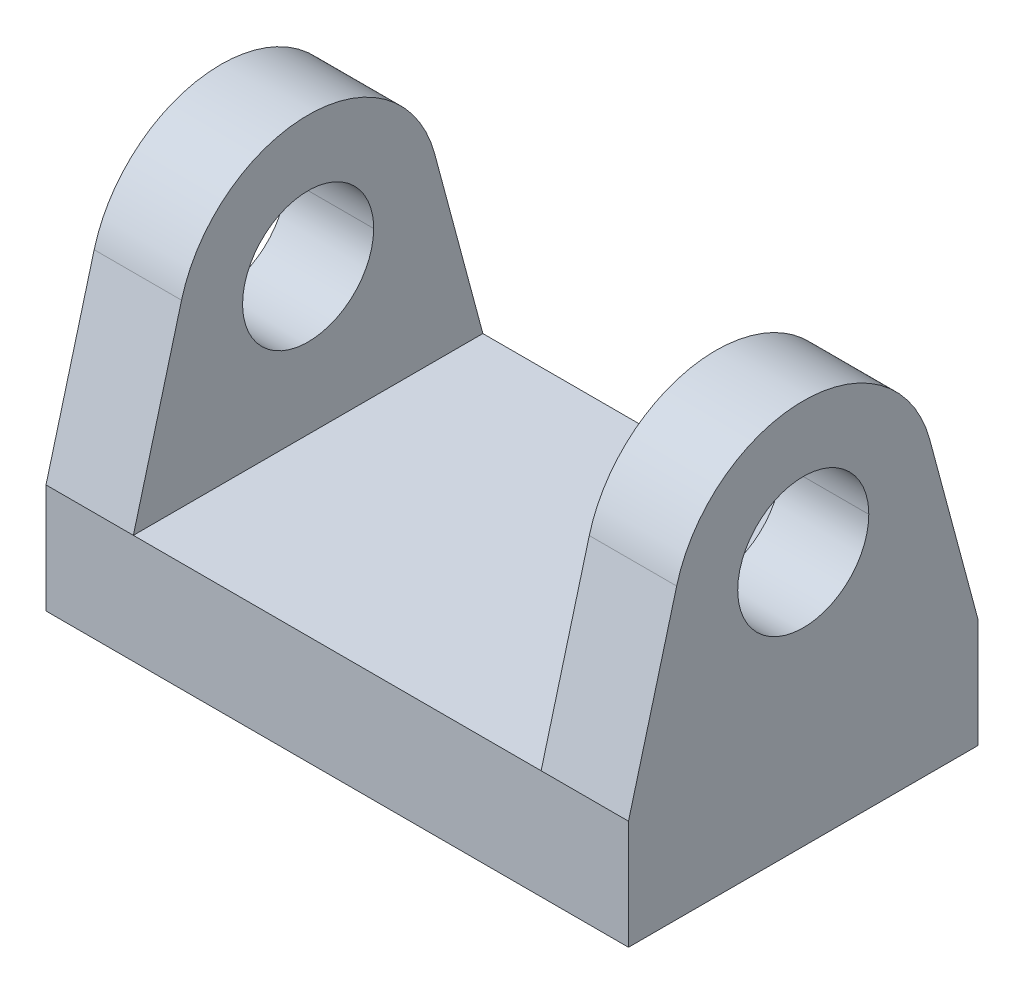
ISO-10303-21;
HEADER;
FILE_DESCRIPTION(('STEP AP214'),'2;1');
FILE_NAME('part.step','',(''),(''),'','','');
FILE_SCHEMA(('AUTOMOTIVE_DESIGN { 1 0 10303 214 1 1 1 1 }'));
ENDSEC;
DATA;
#1=APPLICATION_CONTEXT('core data for automotive mechanical design processes');
#2=APPLICATION_PROTOCOL_DEFINITION('international standard','automotive_design',2000,#1);
#3=PRODUCT_CONTEXT('',#1,'mechanical');
#4=PRODUCT('Part','Part','',(#3));
#5=PRODUCT_RELATED_PRODUCT_CATEGORY('part','',(#4));
#6=PRODUCT_DEFINITION_FORMATION('','',#4);
#7=PRODUCT_DEFINITION_CONTEXT('part definition',#1,'design');
#8=PRODUCT_DEFINITION('design','',#6,#7);
#9=PRODUCT_DEFINITION_SHAPE('','',#8);
#10=(LENGTH_UNIT() NAMED_UNIT(*) SI_UNIT(.MILLI.,.METRE.));
#11=(NAMED_UNIT(*) PLANE_ANGLE_UNIT() SI_UNIT($,.RADIAN.));
#12=(NAMED_UNIT(*) SI_UNIT($,.STERADIAN.) SOLID_ANGLE_UNIT());
#13=UNCERTAINTY_MEASURE_WITH_UNIT(LENGTH_MEASURE(1.E-05),#10,'distance_accuracy_value','');
#14=(GEOMETRIC_REPRESENTATION_CONTEXT(3) GLOBAL_UNCERTAINTY_ASSIGNED_CONTEXT((#13)) GLOBAL_UNIT_ASSIGNED_CONTEXT((#10,
#11,#12)) REPRESENTATION_CONTEXT('',''));
#15=CARTESIAN_POINT('',(0.,0.,0.));
#16=DIRECTION('',(0.,0.,1.));
#17=DIRECTION('',(1.,0.,0.));
#18=AXIS2_PLACEMENT_3D('',#15,#16,#17);
#19=CARTESIAN_POINT('',(-14.,7.5,-12.));
#20=DIRECTION('',(0.,1.,0.));
#21=DIRECTION('',(0.,0.,1.));
#22=AXIS2_PLACEMENT_3D('',#19,#20,#21);
#23=PLANE('',#22);
#24=CARTESIAN_POINT('',(-14.,7.5,12.));
#25=DIRECTION('',(1.,0.,0.));
#26=VECTOR('',#25,1.);
#27=LINE('',#24,#26);
#28=CARTESIAN_POINT('',(-14.,7.5,12.));
#29=VERTEX_POINT('',#28);
#30=CARTESIAN_POINT('',(14.,7.5,12.));
#31=VERTEX_POINT('',#30);
#32=EDGE_CURVE('E11',#29,#31,#27,.T.);
#33=ORIENTED_EDGE('',*,*,#32,.T.);
#34=CARTESIAN_POINT('',(14.,7.5,-12.));
#35=DIRECTION('',(0.,0.,1.));
#36=VECTOR('',#35,1.);
#37=LINE('',#34,#36);
#38=CARTESIAN_POINT('',(14.,7.5,-12.));
#39=VERTEX_POINT('',#38);
#40=EDGE_CURVE('E25',#39,#31,#37,.T.);
#41=ORIENTED_EDGE('',*,*,#40,.F.);
#42=CARTESIAN_POINT('',(14.,7.5,-12.));
#43=DIRECTION('',(-1.,0.,0.));
#44=VECTOR('',#43,1.);
#45=LINE('',#42,#44);
#46=CARTESIAN_POINT('',(-14.,7.5,-12.));
#47=VERTEX_POINT('',#46);
#48=EDGE_CURVE('E520',#39,#47,#45,.T.);
#49=ORIENTED_EDGE('',*,*,#48,.T.);
#50=CARTESIAN_POINT('',(-14.,7.5,-12.));
#51=DIRECTION('',(0.,0.,1.));
#52=VECTOR('',#51,1.);
#53=LINE('',#50,#52);
#54=EDGE_CURVE('E519',#47,#29,#53,.T.);
#55=ORIENTED_EDGE('',*,*,#54,.T.);
#56=EDGE_LOOP('',(#33,#41,#49,#55));
#57=FACE_BOUND('',#56,.T.);
#58=ADVANCED_FACE('F17',(#57),#23,.T.);
#59=CARTESIAN_POINT('',(-14.,7.5,-12.));
#60=DIRECTION('',(1.,0.,0.));
#61=DIRECTION('',(0.,1.,0.));
#62=AXIS2_PLACEMENT_3D('',#59,#60,#61);
#63=PLANE('',#62);
#64=CARTESIAN_POINT('',(-14.,19.8313594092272,-8.69279950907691));
#65=DIRECTION('',(0.,-0.965866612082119,-0.259039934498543));
#66=VECTOR('',#65,1.);
#67=LINE('',#64,#66);
#68=CARTESIAN_POINT('',(-14.,19.8313476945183,-8.69275582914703));
#69=VERTEX_POINT('',#68);
#70=EDGE_CURVE('E508',#69,#47,#67,.T.);
#71=ORIENTED_EDGE('',*,*,#70,.F.);
#72=CARTESIAN_POINT('',(-14.,17.5,0.));
#73=DIRECTION('',(-1.,0.,0.));
#74=DIRECTION('',(0.,0.259039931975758,0.965866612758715));
#75=AXIS2_PLACEMENT_3D('',#72,#73,#74);
#76=CIRCLE('',#75,9.);
#77=CARTESIAN_POINT('',(-14.,19.8313560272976,8.69278698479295));
#78=VERTEX_POINT('',#77);
#79=EDGE_CURVE('E312',#78,#69,#76,.T.);
#80=ORIENTED_EDGE('',*,*,#79,.F.);
#81=CARTESIAN_POINT('',(-14.,7.50000000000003,12.));
#82=DIRECTION('',(0.,0.965866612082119,-0.259039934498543));
#83=VECTOR('',#82,1.);
#84=LINE('',#81,#83);
#85=EDGE_CURVE('E391',#29,#78,#84,.T.);
#86=ORIENTED_EDGE('',*,*,#85,.F.);
#87=ORIENTED_EDGE('',*,*,#54,.F.);
#88=EDGE_LOOP('',(#71,#80,#86,#87));
#89=FACE_BOUND('',#88,.T.);
#90=CARTESIAN_POINT('',(-14.,17.5,-4.5));
#91=CARTESIAN_POINT('',(-14.,17.4997647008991,-4.5));
#92=CARTESIAN_POINT('',(-14.,17.4995294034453,-4.49999998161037));
#93=CARTESIAN_POINT('',(-14.,16.5289747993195,-4.49984827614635));
#94=CARTESIAN_POINT('',(-14.,15.5866983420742,-4.18697437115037));
#95=CARTESIAN_POINT('',(-14.,14.1734421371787,-3.13224492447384));
#96=CARTESIAN_POINT('',(-14.,13.6737251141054,-2.49778943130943));
#97=CARTESIAN_POINT('',(-14.,13.122840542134,-1.2092501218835));
#98=CARTESIAN_POINT('',(-14.,12.9999726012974,-0.6081804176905));
#99=CARTESIAN_POINT('',(-14.,13.0000396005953,0.8790309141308));
#100=CARTESIAN_POINT('',(-14.,13.2568283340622,1.7373965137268));
#101=CARTESIAN_POINT('',(-14.,14.2145541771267,3.1939900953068));
#102=CARTESIAN_POINT('',(-14.,14.8877094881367,3.7647691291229));
#103=CARTESIAN_POINT('',(-14.,16.2522533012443,4.3689504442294));
#104=CARTESIAN_POINT('',(-14.,16.8723513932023,4.4997411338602));
#105=CARTESIAN_POINT('',(-14.,17.5,4.5));
#106=B_SPLINE_CURVE_WITH_KNOTS('',3,(#90,#91,#92,#93,#94,#95,#96,#97,#98,#99,#100,#101,#102,
#103,#104,#105),.UNSPECIFIED.,.F.,.F.,(4,2,2,2,2,2,2,4),(0.,4.95943433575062E-05,
0.204568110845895,0.371873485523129,0.500067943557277,0.685353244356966,0.867637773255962,1.),.UNSPECIFIED.);
#107=CARTESIAN_POINT('',(-14.,17.5,-4.5));
#108=VERTEX_POINT('',#107);
#109=CARTESIAN_POINT('',(-14.,17.5,4.5));
#110=VERTEX_POINT('',#109);
#111=EDGE_CURVE('E521',#108,#110,#106,.T.);
#112=ORIENTED_EDGE('',*,*,#111,.T.);
#113=CARTESIAN_POINT('',(-14.,17.5,4.5));
#114=CARTESIAN_POINT('',(-14.,18.4508974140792,4.4996078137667));
#115=CARTESIAN_POINT('',(-14.,19.3756842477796,4.1996162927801));
#116=CARTESIAN_POINT('',(-14.,20.7869061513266,3.17402896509));
#117=CARTESIAN_POINT('',(-14.,21.2944527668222,2.5458609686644));
#118=CARTESIAN_POINT('',(-14.,21.8692068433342,1.2468617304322));
#119=CARTESIAN_POINT('',(-14.,21.9999717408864,0.627279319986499));
#120=CARTESIAN_POINT('',(-14.,22.0000408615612,-0.907021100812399));
#121=CARTESIAN_POINT('',(-14.,21.7267205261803,-1.7911249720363));
#122=CARTESIAN_POINT('',(-14.,20.7668964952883,-3.19443306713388));
#123=CARTESIAN_POINT('',(-14.,20.1535211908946,-3.71987599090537));
#124=CARTESIAN_POINT('',(-14.,18.8323061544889,-4.35049837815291));
#125=CARTESIAN_POINT('',(-14.,18.1709183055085,-4.5));
#126=CARTESIAN_POINT('',(-14.,17.5,-4.5));
#127=B_SPLINE_CURVE_WITH_KNOTS('',3,(#113,#114,#115,#116,#117,#118,#119,#120,#121,#122,#123,
#124,#125,#126),.UNSPECIFIED.,.F.,.F.,(4,2,2,2,2,2,4),(0.,0.200521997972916,0.367836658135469,
0.50006402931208,0.691259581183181,0.858575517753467,1.),.UNSPECIFIED.);
#128=EDGE_CURVE('E522',#110,#108,#127,.T.);
#129=ORIENTED_EDGE('',*,*,#128,.T.);
#130=EDGE_LOOP('',(#112,#129));
#131=FACE_BOUND('',#130,.T.);
#132=ADVANCED_FACE('F560',(#89,#131),#63,.T.);
#133=CARTESIAN_POINT('',(-14.,17.5,0.));
#134=DIRECTION('',(-1.,0.,0.));
#135=DIRECTION('',(0.,-1.,0.));
#136=AXIS2_PLACEMENT_3D('',#133,#134,#135);
#137=CYLINDRICAL_SURFACE('',#136,4.5);
#138=ORIENTED_EDGE('',*,*,#128,.F.);
#139=CARTESIAN_POINT('',(-14.,17.5,4.5));
#140=DIRECTION('',(-1.,0.,0.));
#141=VECTOR('',#140,1.);
#142=LINE('',#139,#141);
#143=CARTESIAN_POINT('',(-20.,17.5,4.5));
#144=VERTEX_POINT('',#143);
#145=EDGE_CURVE('E527',#110,#144,#142,.T.);
#146=ORIENTED_EDGE('',*,*,#145,.T.);
#147=CARTESIAN_POINT('',(-20.,17.5,0.));
#148=DIRECTION('',(-1.,0.,0.));
#149=DIRECTION('',(0.,0.,1.));
#150=AXIS2_PLACEMENT_3D('',#147,#148,#149);
#151=CIRCLE('',#150,4.5);
#152=CARTESIAN_POINT('',(-20.,17.5,-4.5));
#153=VERTEX_POINT('',#152);
#154=EDGE_CURVE('E530',#144,#153,#151,.T.);
#155=ORIENTED_EDGE('',*,*,#154,.T.);
#156=CARTESIAN_POINT('',(-20.,17.5,-4.5));
#157=DIRECTION('',(1.,0.,0.));
#158=VECTOR('',#157,1.);
#159=LINE('',#156,#158);
#160=EDGE_CURVE('E535',#153,#108,#159,.T.);
#161=ORIENTED_EDGE('',*,*,#160,.T.);
#162=EDGE_LOOP('',(#138,#146,#155,#161));
#163=FACE_BOUND('',#162,.T.);
#164=ADVANCED_FACE('F552',(#163),#137,.F.);
#165=CARTESIAN_POINT('',(-14.,17.5,0.));
#166=DIRECTION('',(-1.,0.,0.));
#167=DIRECTION('',(0.,1.,0.));
#168=AXIS2_PLACEMENT_3D('',#165,#166,#167);
#169=CYLINDRICAL_SURFACE('',#168,4.5);
#170=CARTESIAN_POINT('',(-20.,17.5,0.));
#171=DIRECTION('',(-1.,0.,0.));
#172=DIRECTION('',(0.,0.,-1.));
#173=AXIS2_PLACEMENT_3D('',#170,#171,#172);
#174=CIRCLE('',#173,4.5);
#175=EDGE_CURVE('E486',#153,#144,#174,.T.);
#176=ORIENTED_EDGE('',*,*,#175,.T.);
#177=ORIENTED_EDGE('',*,*,#145,.F.);
#178=ORIENTED_EDGE('',*,*,#111,.F.);
#179=ORIENTED_EDGE('',*,*,#160,.F.);
#180=EDGE_LOOP('',(#176,#177,#178,#179));
#181=FACE_BOUND('',#180,.T.);
#182=ADVANCED_FACE('F432',(#181),#169,.F.);
#183=CARTESIAN_POINT('',(-20.,0.,12.));
#184=DIRECTION('',(-1.,0.,0.));
#185=DIRECTION('',(0.,1.,0.));
#186=AXIS2_PLACEMENT_3D('',#183,#184,#185);
#187=PLANE('',#186);
#188=CARTESIAN_POINT('',(-20.,0.,-12.));
#189=DIRECTION('',(0.,0.,1.));
#190=VECTOR('',#189,1.);
#191=LINE('',#188,#190);
#192=CARTESIAN_POINT('',(-20.,0.,-12.));
#193=VERTEX_POINT('',#192);
#194=CARTESIAN_POINT('',(-20.,0.,12.));
#195=VERTEX_POINT('',#194);
#196=EDGE_CURVE('E410',#193,#195,#191,.T.);
#197=ORIENTED_EDGE('',*,*,#196,.T.);
#198=CARTESIAN_POINT('',(-20.,7.5,12.));
#199=DIRECTION('',(0.,-1.,0.));
#200=VECTOR('',#199,1.);
#201=LINE('',#198,#200);
#202=CARTESIAN_POINT('',(-20.,7.5,12.));
#203=VERTEX_POINT('',#202);
#204=EDGE_CURVE('E409',#203,#195,#201,.T.);
#205=ORIENTED_EDGE('',*,*,#204,.F.);
#206=CARTESIAN_POINT('',(-20.,7.5,12.));
#207=CARTESIAN_POINT('',(-20.,11.610472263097,10.8976571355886));
#208=CARTESIAN_POINT('',(-20.,15.7209445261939,9.79531427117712));
#209=CARTESIAN_POINT('',(-20.,19.8313593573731,8.69279952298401));
#210=CARTESIAN_POINT('',(-20.,19.8313593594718,8.69279952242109));
#211=CARTESIAN_POINT('',(-20.,19.8313593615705,8.69279952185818));
#212=B_SPLINE_CURVE_WITH_KNOTS('',3,(#206,#207,#208,#209,#210,#211),.UNSPECIFIED.,.F.,.F.,(4,2,
4),(0.,39.1716991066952,39.1716991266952),.UNSPECIFIED.);
#213=CARTESIAN_POINT('',(-20.,19.8313593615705,8.69279952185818));
#214=VERTEX_POINT('',#213);
#215=EDGE_CURVE('E407',#203,#214,#212,.T.);
#216=ORIENTED_EDGE('',*,*,#215,.T.);
#217=CARTESIAN_POINT('',(-20.,19.8313593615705,8.69279952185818));
#218=CARTESIAN_POINT('',(-20.,21.1479484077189,8.3396205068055));
#219=CARTESIAN_POINT('',(-20.,22.3662187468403,7.6929787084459));
#220=CARTESIAN_POINT('',(-20.,24.3934035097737,5.93499844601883));
#221=CARTESIAN_POINT('',(-20.,25.1884912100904,4.86104213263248));
#222=CARTESIAN_POINT('',(-20.,26.7842153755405,1.2706132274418));
#223=CARTESIAN_POINT('',(-20.,26.7567034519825,-1.45737566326));
#224=CARTESIAN_POINT('',(-20.,25.0044916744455,-5.1951072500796));
#225=CARTESIAN_POINT('',(-20.,24.0218412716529,-6.3854683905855));
#226=CARTESIAN_POINT('',(-20.,21.900771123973,-7.9280197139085));
#227=CARTESIAN_POINT('',(-20.,20.8971638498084,-8.4068624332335));
#228=CARTESIAN_POINT('',(-20.,19.8313494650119,-8.6927624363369));
#229=B_SPLINE_CURVE_WITH_KNOTS('',3,(#217,#218,#219,#220,#221,#222,#223,#224,#225,#226,#227,
#228),.UNSPECIFIED.,.F.,.F.,(4,2,2,2,2,4),(0.,0.172228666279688,0.339009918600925,
0.668642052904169,0.860572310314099,1.),.UNSPECIFIED.);
#230=CARTESIAN_POINT('',(-20.,19.8313494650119,-8.69276243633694));
#231=VERTEX_POINT('',#230);
#232=EDGE_CURVE('E310',#214,#231,#229,.T.);
#233=ORIENTED_EDGE('',*,*,#232,.T.);
#234=CARTESIAN_POINT('',(-20.,19.8313494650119,-8.6927624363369));
#235=CARTESIAN_POINT('',(-20.,19.8313487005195,-8.6927626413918));
#236=CARTESIAN_POINT('',(-20.,19.8313479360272,-8.6927628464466));
#237=CARTESIAN_POINT('',(-20.,15.7209306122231,-9.7952726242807));
#238=CARTESIAN_POINT('',(-20.,11.6104653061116,-10.8976363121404));
#239=CARTESIAN_POINT('',(-20.,7.5,-12.));
#240=B_SPLINE_CURVE_WITH_KNOTS('',3,(#234,#235,#236,#237,#238,#239),.UNSPECIFIED.,.F.,.F.,(4,2,
4),(0.,1.85989000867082E-07,1.),.UNSPECIFIED.);
#241=CARTESIAN_POINT('',(-20.,7.5,-12.));
#242=VERTEX_POINT('',#241);
#243=EDGE_CURVE('E320',#231,#242,#240,.T.);
#244=ORIENTED_EDGE('',*,*,#243,.T.);
#245=CARTESIAN_POINT('',(-20.,7.5,-12.));
#246=DIRECTION('',(0.,-1.,0.));
#247=VECTOR('',#246,1.);
#248=LINE('',#245,#247);
#249=EDGE_CURVE('E329',#242,#193,#248,.T.);
#250=ORIENTED_EDGE('',*,*,#249,.T.);
#251=EDGE_LOOP('',(#197,#205,#216,#233,#244,#250));
#252=FACE_BOUND('',#251,.T.);
#253=ORIENTED_EDGE('',*,*,#154,.F.);
#254=ORIENTED_EDGE('',*,*,#175,.F.);
#255=EDGE_LOOP('',(#253,#254));
#256=FACE_BOUND('',#255,.T.);
#257=ADVANCED_FACE('F412',(#252,#256),#187,.T.);
#258=CARTESIAN_POINT('',(-20.,0.,-12.));
#259=DIRECTION('',(0.,0.,-1.));
#260=DIRECTION('',(0.,1.,0.));
#261=AXIS2_PLACEMENT_3D('',#258,#259,#260);
#262=PLANE('',#261);
#263=CARTESIAN_POINT('',(20.,0.,-12.));
#264=DIRECTION('',(-1.,0.,0.));
#265=VECTOR('',#264,1.);
#266=LINE('',#263,#265);
#267=CARTESIAN_POINT('',(20.,0.,-12.));
#268=VERTEX_POINT('',#267);
#269=EDGE_CURVE('E474',#268,#193,#266,.T.);
#270=ORIENTED_EDGE('',*,*,#269,.T.);
#271=ORIENTED_EDGE('',*,*,#249,.F.);
#272=CARTESIAN_POINT('',(-14.,7.5,-12.));
#273=DIRECTION('',(-1.,0.,0.));
#274=VECTOR('',#273,1.);
#275=LINE('',#272,#274);
#276=EDGE_CURVE('E324',#47,#242,#275,.T.);
#277=ORIENTED_EDGE('',*,*,#276,.F.);
#278=ORIENTED_EDGE('',*,*,#48,.F.);
#279=CARTESIAN_POINT('',(20.,7.50000000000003,-12.));
#280=DIRECTION('',(-1.,0.,0.));
#281=VECTOR('',#280,1.);
#282=LINE('',#279,#281);
#283=CARTESIAN_POINT('',(20.,7.5,-12.));
#284=VERTEX_POINT('',#283);
#285=EDGE_CURVE('E140',#284,#39,#282,.T.);
#286=ORIENTED_EDGE('',*,*,#285,.F.);
#287=CARTESIAN_POINT('',(20.,7.5,-12.));
#288=DIRECTION('',(0.,-1.,0.));
#289=VECTOR('',#288,1.);
#290=LINE('',#287,#289);
#291=EDGE_CURVE('E477',#284,#268,#290,.T.);
#292=ORIENTED_EDGE('',*,*,#291,.T.);
#293=EDGE_LOOP('',(#270,#271,#277,#278,#286,#292));
#294=FACE_BOUND('',#293,.T.);
#295=ADVANCED_FACE('F431',(#294),#262,.T.);
#296=CARTESIAN_POINT('',(20.,0.,-12.));
#297=DIRECTION('',(1.,0.,0.));
#298=DIRECTION('',(0.,1.,0.));
#299=AXIS2_PLACEMENT_3D('',#296,#297,#298);
#300=PLANE('',#299);
#301=CARTESIAN_POINT('',(20.,0.,12.));
#302=DIRECTION('',(0.,0.,-1.));
#303=VECTOR('',#302,1.);
#304=LINE('',#301,#303);
#305=CARTESIAN_POINT('',(20.,0.,12.));
#306=VERTEX_POINT('',#305);
#307=EDGE_CURVE('E848',#306,#268,#304,.T.);
#308=ORIENTED_EDGE('',*,*,#307,.T.);
#309=ORIENTED_EDGE('',*,*,#291,.F.);
#310=CARTESIAN_POINT('',(20.,19.8313593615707,-8.69279952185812));
#311=DIRECTION('',(0.,-0.965866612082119,-0.259039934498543));
#312=VECTOR('',#311,1.);
#313=LINE('',#310,#312);
#314=CARTESIAN_POINT('',(20.,19.8313476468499,-8.69275584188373));
#315=VERTEX_POINT('',#314);
#316=EDGE_CURVE('E829',#315,#284,#313,.T.);
#317=ORIENTED_EDGE('',*,*,#316,.F.);
#318=CARTESIAN_POINT('',(20.,17.5,0.));
#319=DIRECTION('',(-1.,0.,0.));
#320=DIRECTION('',(0.,0.259039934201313,0.965866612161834));
#321=AXIS2_PLACEMENT_3D('',#318,#319,#320);
#322=CIRCLE('',#321,9.);
#323=CARTESIAN_POINT('',(20.,19.8313494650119,8.69276243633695));
#324=VERTEX_POINT('',#323);
#325=EDGE_CURVE('E146',#324,#315,#322,.T.);
#326=ORIENTED_EDGE('',*,*,#325,.F.);
#327=CARTESIAN_POINT('',(20.,7.5,12.));
#328=DIRECTION('',(0.,0.965866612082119,-0.259039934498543));
#329=VECTOR('',#328,1.);
#330=LINE('',#327,#329);
#331=CARTESIAN_POINT('',(20.,7.5,12.));
#332=VERTEX_POINT('',#331);
#333=EDGE_CURVE('E192',#332,#324,#330,.T.);
#334=ORIENTED_EDGE('',*,*,#333,.F.);
#335=CARTESIAN_POINT('',(20.,7.5,12.));
#336=DIRECTION('',(0.,-1.,0.));
#337=VECTOR('',#336,1.);
#338=LINE('',#335,#337);
#339=EDGE_CURVE('E198',#332,#306,#338,.T.);
#340=ORIENTED_EDGE('',*,*,#339,.T.);
#341=EDGE_LOOP('',(#308,#309,#317,#326,#334,#340));
#342=FACE_BOUND('',#341,.T.);
#343=CARTESIAN_POINT('',(20.,17.5,4.5));
#344=CARTESIAN_POINT('',(20.,18.3197492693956,4.4996669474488));
#345=CARTESIAN_POINT('',(20.,19.1227268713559,4.2766512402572));
#346=CARTESIAN_POINT('',(20.,20.5040291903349,3.443031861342));
#347=CARTESIAN_POINT('',(20.,21.0632568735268,2.8603577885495));
#348=CARTESIAN_POINT('',(20.,21.8777639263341,1.3766605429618));
#349=CARTESIAN_POINT('',(20.,22.0639950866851,0.4776272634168));
#350=CARTESIAN_POINT('',(20.,21.8802043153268,-1.4958009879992));
#351=CARTESIAN_POINT('',(20.,21.3945324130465,-2.50054768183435));
#352=CARTESIAN_POINT('',(20.,19.9173051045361,-3.91588155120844));
#353=CARTESIAN_POINT('',(20.,19.0271154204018,-4.34122325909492));
#354=CARTESIAN_POINT('',(20.,17.8818397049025,-4.48775452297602));
#355=CARTESIAN_POINT('',(20.,17.6910108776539,-4.49992239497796));
#356=CARTESIAN_POINT('',(20.,17.5,-4.5));
#357=B_SPLINE_CURVE_WITH_KNOTS('',3,(#343,#344,#345,#346,#347,#348,#349,#350,#351,#352,#353,
#354,#355,#356),.UNSPECIFIED.,.F.,.F.,(4,2,2,2,2,2,4),(0.,0.172639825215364,0.33972901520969,
0.529069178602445,0.756944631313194,0.959776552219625,1.),.UNSPECIFIED.);
#358=CARTESIAN_POINT('',(20.,17.5,4.5));
#359=VERTEX_POINT('',#358);
#360=CARTESIAN_POINT('',(20.,17.5,-4.5));
#361=VERTEX_POINT('',#360);
#362=EDGE_CURVE('E775',#359,#361,#357,.T.);
#363=ORIENTED_EDGE('',*,*,#362,.T.);
#364=CARTESIAN_POINT('',(20.,17.5,-4.5));
#365=CARTESIAN_POINT('',(20.,16.6802507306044,-4.49966694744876));
#366=CARTESIAN_POINT('',(20.,15.8772731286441,-4.27665124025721));
#367=CARTESIAN_POINT('',(20.,14.4959708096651,-3.443031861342));
#368=CARTESIAN_POINT('',(20.,13.9367431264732,-2.86035778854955));
#369=CARTESIAN_POINT('',(20.,13.1222360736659,-1.3766605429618));
#370=CARTESIAN_POINT('',(20.,12.9360049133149,-0.477627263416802));
#371=CARTESIAN_POINT('',(20.,13.1197956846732,1.4958009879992));
#372=CARTESIAN_POINT('',(20.,13.6054675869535,2.5005476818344));
#373=CARTESIAN_POINT('',(20.,15.0826948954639,3.9158815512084));
#374=CARTESIAN_POINT('',(20.,15.9728845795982,4.3412232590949));
#375=CARTESIAN_POINT('',(20.,17.1181602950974,4.487754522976));
#376=CARTESIAN_POINT('',(20.,17.3089891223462,4.499922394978));
#377=CARTESIAN_POINT('',(20.,17.5,4.5));
#378=B_SPLINE_CURVE_WITH_KNOTS('',3,(#364,#365,#366,#367,#368,#369,#370,#371,#372,#373,#374,
#375,#376,#377),.UNSPECIFIED.,.F.,.F.,(4,2,2,2,2,2,4),(0.,0.172639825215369,0.339729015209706,
0.529069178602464,0.75694463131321,0.959776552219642,1.),.UNSPECIFIED.);
#379=EDGE_CURVE('E725',#361,#359,#378,.T.);
#380=ORIENTED_EDGE('',*,*,#379,.T.);
#381=EDGE_LOOP('',(#363,#380));
#382=FACE_BOUND('',#381,.T.);
#383=ADVANCED_FACE('F747',(#342,#382),#300,.T.);
#384=CARTESIAN_POINT('',(14.,17.5,0.));
#385=DIRECTION('',(1.,0.,0.));
#386=DIRECTION('',(0.,1.,0.));
#387=AXIS2_PLACEMENT_3D('',#384,#385,#386);
#388=CYLINDRICAL_SURFACE('',#387,4.5);
#389=ORIENTED_EDGE('',*,*,#379,.F.);
#390=CARTESIAN_POINT('',(14.,17.5,-4.5));
#391=DIRECTION('',(1.,0.,0.));
#392=VECTOR('',#391,1.);
#393=LINE('',#390,#392);
#394=CARTESIAN_POINT('',(14.,17.5,-4.5));
#395=VERTEX_POINT('',#394);
#396=EDGE_CURVE('E722',#395,#361,#393,.T.);
#397=ORIENTED_EDGE('',*,*,#396,.F.);
#398=CARTESIAN_POINT('',(14.,17.5,0.));
#399=DIRECTION('',(-1.,0.,0.));
#400=DIRECTION('',(0.,0.,-1.));
#401=AXIS2_PLACEMENT_3D('',#398,#399,#400);
#402=CIRCLE('',#401,4.5);
#403=CARTESIAN_POINT('',(14.,17.5,4.5));
#404=VERTEX_POINT('',#403);
#405=EDGE_CURVE('E715',#395,#404,#402,.T.);
#406=ORIENTED_EDGE('',*,*,#405,.T.);
#407=CARTESIAN_POINT('',(20.,17.5,4.5));
#408=DIRECTION('',(-1.,0.,0.));
#409=VECTOR('',#408,1.);
#410=LINE('',#407,#409);
#411=EDGE_CURVE('E723',#359,#404,#410,.T.);
#412=ORIENTED_EDGE('',*,*,#411,.F.);
#413=EDGE_LOOP('',(#389,#397,#406,#412));
#414=FACE_BOUND('',#413,.T.);
#415=ADVANCED_FACE('F739',(#414),#388,.F.);
#416=CARTESIAN_POINT('',(14.,17.5,0.));
#417=DIRECTION('',(1.,0.,0.));
#418=DIRECTION('',(0.,-1.,0.));
#419=AXIS2_PLACEMENT_3D('',#416,#417,#418);
#420=CYLINDRICAL_SURFACE('',#419,4.5);
#421=CARTESIAN_POINT('',(14.,17.5,0.));
#422=DIRECTION('',(-1.,0.,0.));
#423=DIRECTION('',(0.,0.,1.));
#424=AXIS2_PLACEMENT_3D('',#421,#422,#423);
#425=CIRCLE('',#424,4.5);
#426=EDGE_CURVE('E717',#404,#395,#425,.T.);
#427=ORIENTED_EDGE('',*,*,#426,.T.);
#428=ORIENTED_EDGE('',*,*,#396,.T.);
#429=ORIENTED_EDGE('',*,*,#362,.F.);
#430=ORIENTED_EDGE('',*,*,#411,.T.);
#431=EDGE_LOOP('',(#427,#428,#429,#430));
#432=FACE_BOUND('',#431,.T.);
#433=ADVANCED_FACE('F690',(#432),#420,.F.);
#434=CARTESIAN_POINT('',(14.,26.5886691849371,-12.));
#435=DIRECTION('',(-1.,0.,0.));
#436=DIRECTION('',(0.,-1.,0.));
#437=AXIS2_PLACEMENT_3D('',#434,#435,#436);
#438=PLANE('',#437);
#439=CARTESIAN_POINT('',(14.,7.5,12.));
#440=CARTESIAN_POINT('',(14.,11.6104593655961,10.8976449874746));
#441=CARTESIAN_POINT('',(14.,15.7209187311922,9.7952899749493));
#442=CARTESIAN_POINT('',(14.,19.8313476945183,8.692755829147));
#443=B_SPLINE_CURVE_WITH_KNOTS('',3,(#439,#440,#441,#442),.UNSPECIFIED.,.F.,.F.,(4,4),(0.,1.),.UNSPECIFIED.);
#444=CARTESIAN_POINT('',(14.,19.8313476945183,8.69275582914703));
#445=VERTEX_POINT('',#444);
#446=EDGE_CURVE('E123',#31,#445,#443,.T.);
#447=ORIENTED_EDGE('',*,*,#446,.T.);
#448=CARTESIAN_POINT('',(14.,19.8313476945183,8.692755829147));
#449=CARTESIAN_POINT('',(14.,19.8313490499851,8.6927554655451));
#450=CARTESIAN_POINT('',(14.,19.8313504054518,8.6927551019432));
#451=CARTESIAN_POINT('',(14.,21.1479176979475,8.3395878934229));
#452=CARTESIAN_POINT('',(14.,22.3661917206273,7.6929499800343));
#453=CARTESIAN_POINT('',(14.,24.3933792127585,5.9349786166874));
#454=CARTESIAN_POINT('',(14.,25.1884669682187,4.8610287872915));
#455=CARTESIAN_POINT('',(14.,26.3316575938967,2.288830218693));
#456=CARTESIAN_POINT('',(14.,26.5886691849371,0.793827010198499));
#457=CARTESIAN_POINT('',(14.,26.333980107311,-2.48899026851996));
#458=CARTESIAN_POINT('',(14.,25.6612479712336,-4.19806660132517));
#459=CARTESIAN_POINT('',(14.,23.5448111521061,-6.85730623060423));
#460=CARTESIAN_POINT('',(14.,22.2324804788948,-7.82094599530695));
#461=CARTESIAN_POINT('',(14.,20.4416568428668,-8.51161161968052));
#462=CARTESIAN_POINT('',(14.,20.1388028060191,-8.61032496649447));
#463=CARTESIAN_POINT('',(14.,19.8313567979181,-8.69278677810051));
#464=CARTESIAN_POINT('',(14.,19.8313564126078,-8.69278688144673));
#465=CARTESIAN_POINT('',(14.,19.8313560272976,-8.69278698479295));
#466=B_SPLINE_CURVE_WITH_KNOTS('',3,(#448,#449,#450,#451,#452,#453,#454,#455,#456,#457,#458,
#459,#460,#461,#462,#463,#464,#465),.UNSPECIFIED.,.F.,.F.,(4,2,2,2,2,2,2,2,4),(0.,
1.77772225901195E-07,0.172670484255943,0.33987896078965,0.52921625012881,0.756903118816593,
0.959679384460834,0.999999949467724,1.),.UNSPECIFIED.);
#467=CARTESIAN_POINT('',(14.,19.8313560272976,-8.69278698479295));
#468=VERTEX_POINT('',#467);
#469=EDGE_CURVE('E114',#445,#468,#466,.T.);
#470=ORIENTED_EDGE('',*,*,#469,.T.);
#471=CARTESIAN_POINT('',(14.,19.8313560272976,-8.69278698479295));
#472=CARTESIAN_POINT('',(14.,15.7209098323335,-9.79522558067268));
#473=CARTESIAN_POINT('',(14.,11.6104549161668,-10.8976127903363));
#474=CARTESIAN_POINT('',(14.,7.5,-12.));
#475=B_SPLINE_CURVE_WITH_KNOTS('',3,(#471,#472,#473,#474),.UNSPECIFIED.,.F.,.F.,(4,4),(0.,1.),.UNSPECIFIED.);
#476=EDGE_CURVE('E119',#468,#39,#475,.T.);
#477=ORIENTED_EDGE('',*,*,#476,.T.);
#478=ORIENTED_EDGE('',*,*,#40,.T.);
#479=EDGE_LOOP('',(#447,#470,#477,#478));
#480=FACE_BOUND('',#479,.T.);
#481=ORIENTED_EDGE('',*,*,#405,.F.);
#482=ORIENTED_EDGE('',*,*,#426,.F.);
#483=EDGE_LOOP('',(#481,#482));
#484=FACE_BOUND('',#483,.T.);
#485=ADVANCED_FACE('F117',(#480,#484),#438,.T.);
#486=CARTESIAN_POINT('',(14.,19.8313593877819,-8.69279951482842));
#487=DIRECTION('',(0.,0.259039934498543,-0.965866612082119));
#488=DIRECTION('',(1.,0.,0.));
#489=AXIS2_PLACEMENT_3D('',#486,#487,#488);
#490=PLANE('',#489);
#491=ORIENTED_EDGE('',*,*,#316,.T.);
#492=ORIENTED_EDGE('',*,*,#285,.T.);
#493=ORIENTED_EDGE('',*,*,#476,.F.);
#494=CARTESIAN_POINT('',(14.,19.8313593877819,-8.69279951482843));
#495=DIRECTION('',(1.,-4.36852810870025E-09,-1.1716145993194E-09));
#496=VECTOR('',#495,1.);
#497=LINE('',#494,#496);
#498=EDGE_CURVE('E137',#468,#315,#497,.T.);
#499=ORIENTED_EDGE('',*,*,#498,.T.);
#500=EDGE_LOOP('',(#491,#492,#493,#499));
#501=FACE_BOUND('',#500,.T.);
#502=ADVANCED_FACE('F136',(#501),#490,.T.);
#503=CARTESIAN_POINT('',(14.,17.5,0.));
#504=DIRECTION('',(1.,0.,0.));
#505=DIRECTION('',(0.,-1.,2.65974947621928E-09));
#506=AXIS2_PLACEMENT_3D('',#503,#504,#505);
#507=CYLINDRICAL_SURFACE('',#506,9.);
#508=ORIENTED_EDGE('',*,*,#325,.T.);
#509=ORIENTED_EDGE('',*,*,#498,.F.);
#510=ORIENTED_EDGE('',*,*,#469,.F.);
#511=CARTESIAN_POINT('',(14.,19.8313594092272,8.69279950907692));
#512=CARTESIAN_POINT('',(14.25,19.8313594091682,8.69279950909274));
#513=CARTESIAN_POINT('',(14.5,19.8313594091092,8.69279950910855));
#514=CARTESIAN_POINT('',(15.,19.8313594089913,8.69279950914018));
#515=CARTESIAN_POINT('',(15.25,19.8313594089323,8.692799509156));
#516=CARTESIAN_POINT('',(15.75,19.8313594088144,8.69279950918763));
#517=CARTESIAN_POINT('',(16.,19.8313594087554,8.69279950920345));
#518=CARTESIAN_POINT('',(16.5,19.8313594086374,8.69279950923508));
#519=CARTESIAN_POINT('',(16.75,19.8313594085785,8.6927995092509));
#520=CARTESIAN_POINT('',(17.25,19.8313594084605,8.69279950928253));
#521=CARTESIAN_POINT('',(17.5,19.8313594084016,8.69279950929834));
#522=CARTESIAN_POINT('',(18.,19.8313594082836,8.69279950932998));
#523=CARTESIAN_POINT('',(18.25,19.8313594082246,8.69279950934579));
#524=CARTESIAN_POINT('',(18.75,19.8313594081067,8.69279950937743));
#525=CARTESIAN_POINT('',(19.,19.8313594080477,8.69279950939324));
#526=CARTESIAN_POINT('',(19.5,19.8313594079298,8.69279950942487));
#527=CARTESIAN_POINT('',(19.75,19.8313594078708,8.69279950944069));
#528=CARTESIAN_POINT('',(20.,19.8313594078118,8.69279950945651));
#529=B_SPLINE_CURVE_WITH_KNOTS('',3,(#511,#512,#513,#514,#515,#516,#517,#518,#519,#520,#521,
#522,#523,#524,#525,#526,#527,#528),.UNSPECIFIED.,.F.,.F.,(4,2,2,2,2,2,2,2,4),(0.,
0.750000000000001,1.5,2.25,3.,3.75,4.5,5.25,6.),.UNSPECIFIED.);
#530=EDGE_CURVE('E148',#445,#324,#529,.T.);
#531=ORIENTED_EDGE('',*,*,#530,.T.);
#532=EDGE_LOOP('',(#508,#509,#510,#531));
#533=FACE_BOUND('',#532,.T.);
#534=ADVANCED_FACE('F145',(#533),#507,.T.);
#535=CARTESIAN_POINT('',(14.,7.5,12.));
#536=DIRECTION('',(0.,0.259039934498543,0.965866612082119));
#537=DIRECTION('',(1.,0.,0.));
#538=AXIS2_PLACEMENT_3D('',#535,#536,#537);
#539=PLANE('',#538);
#540=ORIENTED_EDGE('',*,*,#333,.T.);
#541=ORIENTED_EDGE('',*,*,#530,.F.);
#542=ORIENTED_EDGE('',*,*,#446,.F.);
#543=CARTESIAN_POINT('',(14.,7.5,12.));
#544=DIRECTION('',(1.,0.,0.));
#545=VECTOR('',#544,1.);
#546=LINE('',#543,#545);
#547=EDGE_CURVE('E190',#31,#332,#546,.T.);
#548=ORIENTED_EDGE('',*,*,#547,.T.);
#549=EDGE_LOOP('',(#540,#541,#542,#548));
#550=FACE_BOUND('',#549,.T.);
#551=ADVANCED_FACE('F166',(#550),#539,.T.);
#552=CARTESIAN_POINT('',(20.,0.,12.));
#553=DIRECTION('',(0.,0.,1.));
#554=DIRECTION('',(0.,1.,0.));
#555=AXIS2_PLACEMENT_3D('',#552,#553,#554);
#556=PLANE('',#555);
#557=CARTESIAN_POINT('',(-20.,0.,12.));
#558=DIRECTION('',(1.,0.,0.));
#559=VECTOR('',#558,1.);
#560=LINE('',#557,#559);
#561=EDGE_CURVE('E238',#195,#306,#560,.T.);
#562=ORIENTED_EDGE('',*,*,#561,.T.);
#563=ORIENTED_EDGE('',*,*,#339,.F.);
#564=ORIENTED_EDGE('',*,*,#547,.F.);
#565=ORIENTED_EDGE('',*,*,#32,.F.);
#566=CARTESIAN_POINT('',(-20.,7.50000000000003,12.));
#567=DIRECTION('',(1.,0.,0.));
#568=VECTOR('',#567,1.);
#569=LINE('',#566,#568);
#570=EDGE_CURVE('E292',#203,#29,#569,.T.);
#571=ORIENTED_EDGE('',*,*,#570,.F.);
#572=ORIENTED_EDGE('',*,*,#204,.T.);
#573=EDGE_LOOP('',(#562,#563,#564,#565,#571,#572));
#574=FACE_BOUND('',#573,.T.);
#575=ADVANCED_FACE('F244',(#574),#556,.T.);
#576=CARTESIAN_POINT('',(-20.,19.8313593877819,8.69279951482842));
#577=DIRECTION('',(0.,0.259039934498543,0.965866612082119));
#578=DIRECTION('',(0.,-0.965866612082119,0.259039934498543));
#579=AXIS2_PLACEMENT_3D('',#576,#577,#578);
#580=PLANE('',#579);
#581=ORIENTED_EDGE('',*,*,#215,.F.);
#582=ORIENTED_EDGE('',*,*,#570,.T.);
#583=ORIENTED_EDGE('',*,*,#85,.T.);
#584=CARTESIAN_POINT('',(-14.,19.8313593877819,8.69279951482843));
#585=DIRECTION('',(-1.,-4.36856858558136E-09,1.17162529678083E-09));
#586=VECTOR('',#585,1.);
#587=LINE('',#584,#586);
#588=EDGE_CURVE('E293',#78,#214,#587,.T.);
#589=ORIENTED_EDGE('',*,*,#588,.T.);
#590=EDGE_LOOP('',(#581,#582,#583,#589));
#591=FACE_BOUND('',#590,.T.);
#592=ADVANCED_FACE('F253',(#591),#580,.T.);
#593=CARTESIAN_POINT('',(-14.,17.5,0.));
#594=DIRECTION('',(-1.,0.,0.));
#595=DIRECTION('',(0.,-1.,-2.65974947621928E-09));
#596=AXIS2_PLACEMENT_3D('',#593,#594,#595);
#597=CYLINDRICAL_SURFACE('',#596,9.);
#598=ORIENTED_EDGE('',*,*,#232,.F.);
#599=ORIENTED_EDGE('',*,*,#588,.F.);
#600=ORIENTED_EDGE('',*,*,#79,.T.);
#601=CARTESIAN_POINT('',(-14.,19.8313594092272,-8.69279950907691));
#602=CARTESIAN_POINT('',(-14.25,19.8313594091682,-8.69279950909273));
#603=CARTESIAN_POINT('',(-14.5,19.8313594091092,-8.69279950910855));
#604=CARTESIAN_POINT('',(-15.,19.8313594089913,-8.69279950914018));
#605=CARTESIAN_POINT('',(-15.25,19.8313594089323,-8.69279950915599));
#606=CARTESIAN_POINT('',(-15.75,19.8313594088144,-8.69279950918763));
#607=CARTESIAN_POINT('',(-16.,19.8313594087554,-8.69279950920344));
#608=CARTESIAN_POINT('',(-16.5,19.8313594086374,-8.69279950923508));
#609=CARTESIAN_POINT('',(-16.75,19.8313594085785,-8.69279950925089));
#610=CARTESIAN_POINT('',(-17.25,19.8313594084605,-8.69279950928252));
#611=CARTESIAN_POINT('',(-17.5,19.8313594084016,-8.69279950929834));
#612=CARTESIAN_POINT('',(-18.,19.8313594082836,-8.69279950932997));
#613=CARTESIAN_POINT('',(-18.25,19.8313594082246,-8.69279950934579));
#614=CARTESIAN_POINT('',(-18.75,19.8313594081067,-8.69279950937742));
#615=CARTESIAN_POINT('',(-19.,19.8313594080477,-8.69279950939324));
#616=CARTESIAN_POINT('',(-19.5,19.8313594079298,-8.69279950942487));
#617=CARTESIAN_POINT('',(-19.75,19.8313594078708,-8.69279950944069));
#618=CARTESIAN_POINT('',(-20.,19.8313594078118,-8.69279950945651));
#619=B_SPLINE_CURVE_WITH_KNOTS('',3,(#601,#602,#603,#604,#605,#606,#607,#608,#609,#610,#611,
#612,#613,#614,#615,#616,#617,#618),.UNSPECIFIED.,.F.,.F.,(4,2,2,2,2,2,2,2,4),(0.,
0.750000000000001,1.5,2.25,3.,3.75,4.5,5.25,6.),.UNSPECIFIED.);
#620=EDGE_CURVE('E299',#69,#231,#619,.T.);
#621=ORIENTED_EDGE('',*,*,#620,.T.);
#622=EDGE_LOOP('',(#598,#599,#600,#621));
#623=FACE_BOUND('',#622,.T.);
#624=ADVANCED_FACE('F309',(#623),#597,.T.);
#625=CARTESIAN_POINT('',(-20.,7.5,-12.));
#626=DIRECTION('',(0.,0.259039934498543,-0.965866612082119));
#627=DIRECTION('',(0.,0.965866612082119,0.259039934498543));
#628=AXIS2_PLACEMENT_3D('',#625,#626,#627);
#629=PLANE('',#628);
#630=ORIENTED_EDGE('',*,*,#243,.F.);
#631=ORIENTED_EDGE('',*,*,#620,.F.);
#632=ORIENTED_EDGE('',*,*,#70,.T.);
#633=ORIENTED_EDGE('',*,*,#276,.T.);
#634=EDGE_LOOP('',(#630,#631,#632,#633));
#635=FACE_BOUND('',#634,.T.);
#636=ADVANCED_FACE('F322',(#635),#629,.T.);
#637=CARTESIAN_POINT('',(-20.,0.,-12.));
#638=DIRECTION('',(0.,-1.,0.));
#639=DIRECTION('',(1.,0.,0.));
#640=AXIS2_PLACEMENT_3D('',#637,#638,#639);
#641=PLANE('',#640);
#642=ORIENTED_EDGE('',*,*,#196,.F.);
#643=ORIENTED_EDGE('',*,*,#269,.F.);
#644=ORIENTED_EDGE('',*,*,#307,.F.);
#645=ORIENTED_EDGE('',*,*,#561,.F.);
#646=EDGE_LOOP('',(#642,#643,#644,#645));
#647=FACE_BOUND('',#646,.T.);
#648=ADVANCED_FACE('F484',(#647),#641,.T.);
#649=CLOSED_SHELL('',(#58,#132,#164,#182,#257,#295,#383,#415,#433,#485,#502,#534,#551,#575,#592,
#624,#636,#648));
#650=MANIFOLD_SOLID_BREP('B1',#649);
#651=ADVANCED_BREP_SHAPE_REPRESENTATION('',(#18,#650),#14);
#652=SHAPE_DEFINITION_REPRESENTATION(#9,#651);
ENDSEC;
END-ISO-10303-21;
